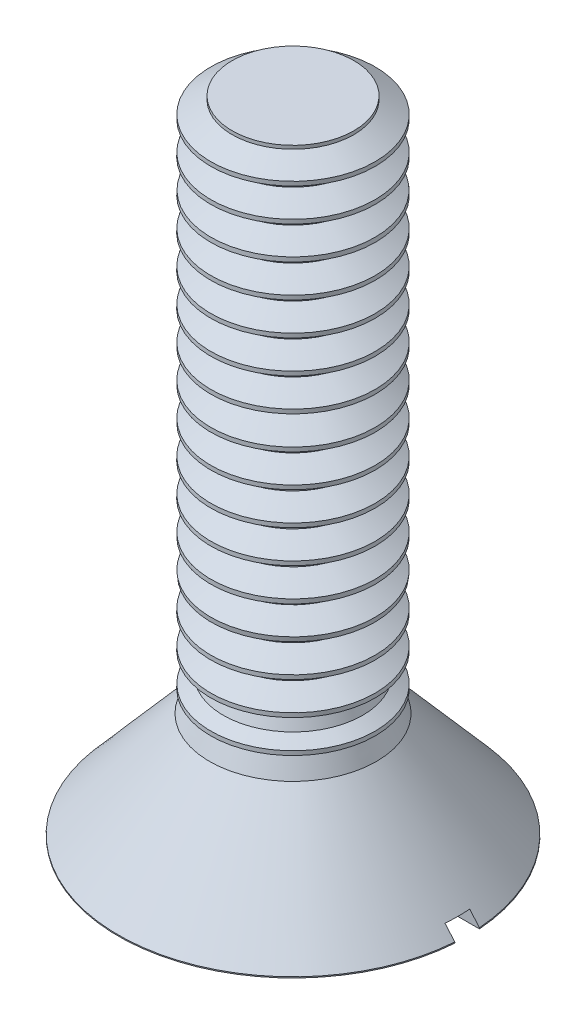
from build123d import *

# Parameters (mm, degrees)
CUT_EXTRUDE_1_DEPTH = 0.3


with BuildPart() as part:
    # Sketch 2 → Revolve 5 (revolve)
    with BuildSketch(Plane.XY, mode=Mode.PRIVATE) as revolve_5_sk:
        Polygon((-6.552153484, 0.015391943), (-2.303622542, 0.015391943), (-2.303622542, 0.041599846), (-2.303622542, 15.609009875), (-3.784192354, 15.609009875), (-3.784192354, 15.525666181), (-4.30387253, 15.217292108), (-4.30387253, 15.117279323), (-3.784192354, 14.80890525), (-3.784192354, 14.72556625), (-4.30387253, 14.417192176), (-4.305520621, 14.317098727), (-3.784192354, 14.008805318), (-3.784192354, 13.925463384), (-4.300398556, 13.62201611), (-4.305501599, 13.516997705), (-3.784192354, 13.208705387), (-3.784192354, 13.125368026), (-4.30387253, 12.816991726), (-4.305502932, 12.716897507), (-3.784192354, 12.408606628), (-3.784192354, 12.325265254), (-4.30387253, 12.016891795), (-4.305486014, 11.916798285), (-3.784192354, 11.608503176), (-3.784192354, 11.525165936), (-4.30387253, 11.216791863), (-4.30549401, 11.116698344), (-3.784192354, 10.808405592), (-3.784192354, 10.725066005), (-4.30387253, 10.416691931), (-4.303947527, 10.315557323), (-3.784192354, 10.008303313), (-4.30387253, 9.616592), (-4.30387253, 9.514419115), (-3.784192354, 9.208205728), (-3.784192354, 9.124857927), (-4.30387253, 8.816492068), (-4.30387253, 8.71647987), (-3.784192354, 8.408105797), (-3.784192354, 8.32476621), (-4.30387253, 8.016392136), (-4.305500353, 7.91629854), (-3.784192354, 7.608005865), (-3.784192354, 7.524666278), (-4.30387253, 7.216292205), (-4.305504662, 7.116199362), (-3.784192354, 6.807905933), (-3.784192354, 6.724566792), (-4.30387253, 6.416192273), (-4.302835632, 6.30885622), (-3.784192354, 6.007804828), (-3.784192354, 5.924462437), (-4.30387253, 5.616092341), (-4.291662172, 5.503636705), (-3.784192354, 5.216042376), (-3.784192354, 5.124356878), (-4.30387253, 4.81599241), (-4.305505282, 4.715897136), (-3.784192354, 4.415942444), (-3.784192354, 4.324265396), (-4.30387253, 4.015891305), (-4.305516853, 3.915797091), (-3.889267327, 3.668707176), (-4.001588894, 3.397537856), (-4.30387253, 3.215791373), (-4.305523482, 3.115697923), (-4.156322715, 3.023979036), (-4.335372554, 2.591713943), (-6.552153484, 0.041599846), align=None)
    revolve(revolve_5_sk.sketch.rotate(Axis((-2.303622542, -0.786493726, 0), (0, 1, 0)), 180), axis=Axis((-2.303622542, -0.786493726, 0), (0, 1, 0)))

    # Sketch 4 → Cut-Extrude 1 (cut)
    with BuildSketch(Plane.XZ.offset(-0.015391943)):
        Polygon((1.9449084, 0), (1.9449084, -0.3), (-7.571156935, -0.3), (-7.571156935, 0.2), (-7.571156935, 0.3), (1.9449084, 0.3), align=None)
    extrude(amount=-CUT_EXTRUDE_1_DEPTH, mode=Mode.SUBTRACT)


solid = part.part
